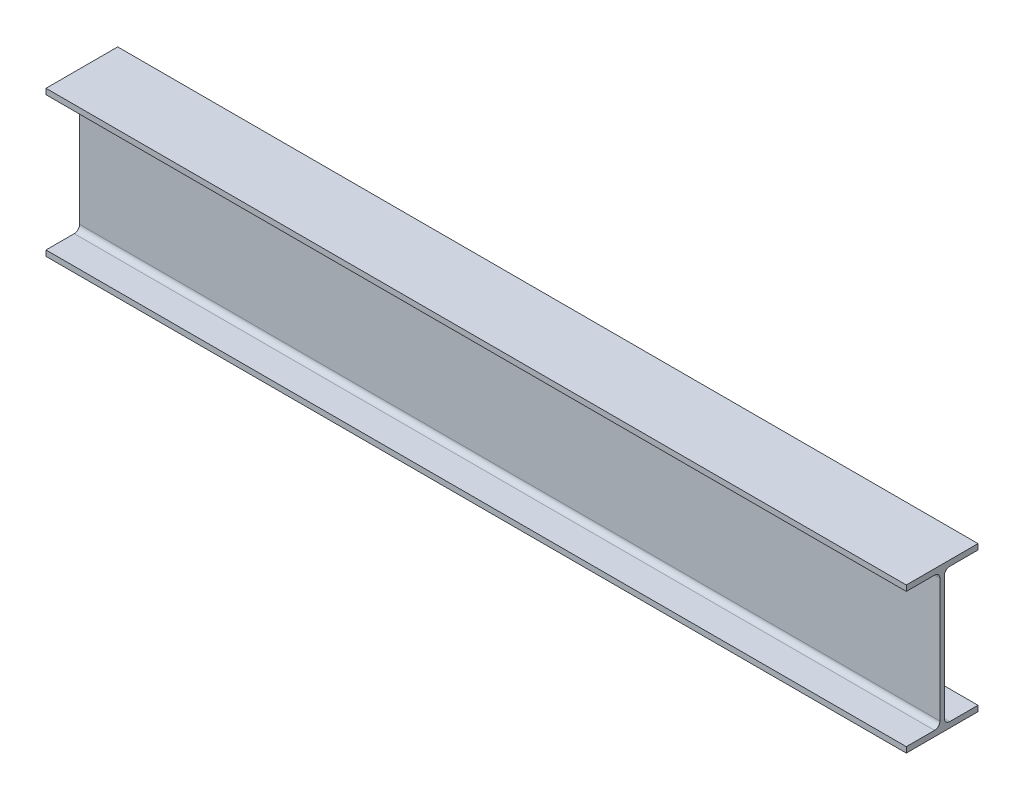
from build123d import *

# Parameters (mm, degrees)
BOSS_EXTRUDE1_DEPTH = 609.6


with BuildPart() as part:
    # Sketch1 → Boss-Extrude1 (new, symmetric)
    with BuildSketch(Plane(origin=(0, 0, 0), x_dir=(0, 0, -1), z_dir=(1, 0, 0))):
        with BuildLine():
            Line((-50.8, 103.1875), (50.8, 103.1875))
            Line((50.8, 103.1875), (50.8, 95.25))
            Line((50.8, 95.25), (10.795, 95.25))
            ThreePointArc((10.795, 95.25), (5.406846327, 93.018153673), (3.175, 87.63))
            Line((3.175, 87.63), (3.175, -87.63))
            ThreePointArc((3.175, -87.63), (5.406846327, -93.018153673), (10.795, -95.25))
            Line((10.795, -95.25), (50.8, -95.25))
            Line((50.8, -95.25), (50.8, -103.1875))
            Line((50.8, -103.1875), (-50.8, -103.1875))
            Line((-50.8, -103.1875), (-50.8, -95.25))
            Line((-50.8, -95.25), (-10.795, -95.25))
            ThreePointArc((-10.795, -95.25), (-5.406846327, -93.018153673), (-3.175, -87.63))
            Line((-3.175, -87.63), (-3.175, 87.63))
            ThreePointArc((-3.175, 87.63), (-5.406846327, 93.018153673), (-10.795, 95.25))
            Line((-10.795, 95.25), (-50.8, 95.25))
            Line((-50.8, 95.25), (-50.8, 103.1875))
        make_face()
    extrude(amount=BOSS_EXTRUDE1_DEPTH, both=True)


solid = part.part
